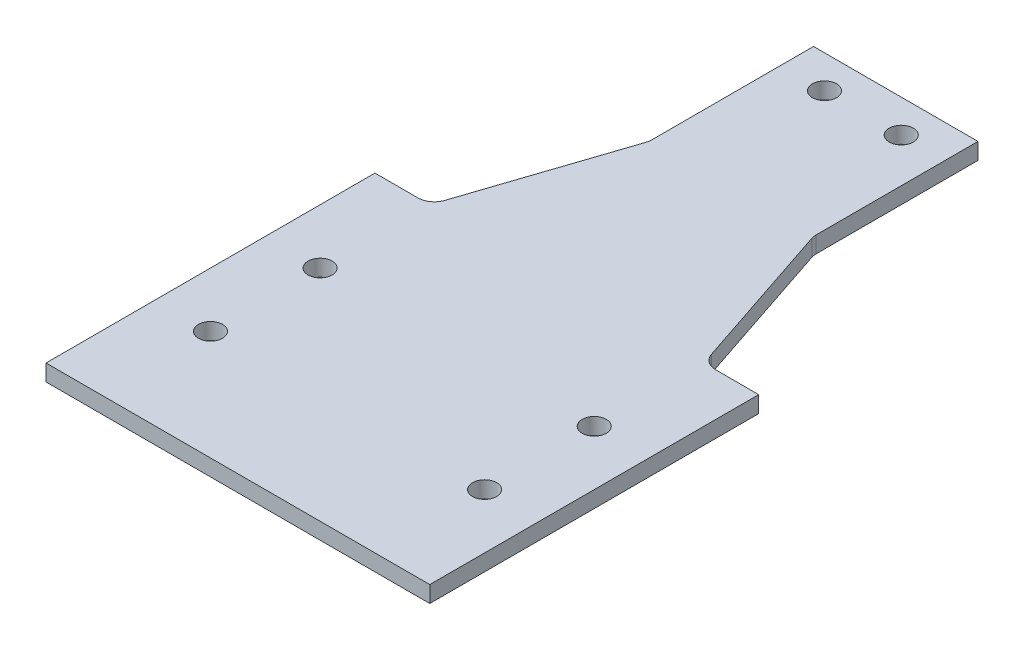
ISO-10303-21;
HEADER;
FILE_DESCRIPTION(('STEP AP214'),'2;1');
FILE_NAME('part.step','',(''),(''),'','','');
FILE_SCHEMA(('AUTOMOTIVE_DESIGN { 1 0 10303 214 1 1 1 1 }'));
ENDSEC;
DATA;
#1=APPLICATION_CONTEXT('core data for automotive mechanical design processes');
#2=APPLICATION_PROTOCOL_DEFINITION('international standard','automotive_design',2000,#1);
#3=PRODUCT_CONTEXT('',#1,'mechanical');
#4=PRODUCT('Part','Part','',(#3));
#5=PRODUCT_RELATED_PRODUCT_CATEGORY('part','',(#4));
#6=PRODUCT_DEFINITION_FORMATION('','',#4);
#7=PRODUCT_DEFINITION_CONTEXT('part definition',#1,'design');
#8=PRODUCT_DEFINITION('design','',#6,#7);
#9=PRODUCT_DEFINITION_SHAPE('','',#8);
#10=(LENGTH_UNIT() NAMED_UNIT(*) SI_UNIT(.MILLI.,.METRE.));
#11=(NAMED_UNIT(*) PLANE_ANGLE_UNIT() SI_UNIT($,.RADIAN.));
#12=(NAMED_UNIT(*) SI_UNIT($,.STERADIAN.) SOLID_ANGLE_UNIT());
#13=UNCERTAINTY_MEASURE_WITH_UNIT(LENGTH_MEASURE(1.E-05),#10,'distance_accuracy_value','');
#14=(GEOMETRIC_REPRESENTATION_CONTEXT(3) GLOBAL_UNCERTAINTY_ASSIGNED_CONTEXT((#13)) GLOBAL_UNIT_ASSIGNED_CONTEXT((#10,
#11,#12)) REPRESENTATION_CONTEXT('',''));
#15=CARTESIAN_POINT('',(0.,0.,0.));
#16=DIRECTION('',(0.,0.,1.));
#17=DIRECTION('',(1.,0.,0.));
#18=AXIS2_PLACEMENT_3D('',#15,#16,#17);
#19=CARTESIAN_POINT('',(-18.,3.,-0.486832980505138));
#20=DIRECTION('',(0.,-1.,0.));
#21=DIRECTION('',(0.,0.,-1.));
#22=AXIS2_PLACEMENT_3D('',#19,#20,#21);
#23=CYLINDRICAL_SURFACE('',#22,3.);
#24=CARTESIAN_POINT('',(-18.,0.,-0.486832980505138));
#25=DIRECTION('',(0.,1.,0.));
#26=DIRECTION('',(0.,0.,1.));
#27=AXIS2_PLACEMENT_3D('',#24,#25,#26);
#28=CIRCLE('',#27,3.);
#29=CARTESIAN_POINT('',(-15.1539501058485,0.,0.461850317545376));
#30=VERTEX_POINT('',#29);
#31=CARTESIAN_POINT('',(-15.,0.,-0.486832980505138));
#32=VERTEX_POINT('',#31);
#33=EDGE_CURVE('E267',#30,#32,#28,.T.);
#34=ORIENTED_EDGE('',*,*,#33,.F.);
#35=DIRECTION('',(0.,-1.,0.));
#36=VECTOR('',#35,1.);
#37=CARTESIAN_POINT('',(-15.1539501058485,0.,0.461850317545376));
#38=LINE('',#37,#36);
#39=CARTESIAN_POINT('',(-15.1539501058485,3.,0.461850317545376));
#40=VERTEX_POINT('',#39);
#41=EDGE_CURVE('E11',#40,#30,#38,.T.);
#42=ORIENTED_EDGE('',*,*,#41,.F.);
#43=CARTESIAN_POINT('',(-18.,3.,-0.486832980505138));
#44=DIRECTION('',(0.,-1.,0.));
#45=DIRECTION('',(0.,0.,1.));
#46=AXIS2_PLACEMENT_3D('',#43,#44,#45);
#47=CIRCLE('',#46,3.);
#48=CARTESIAN_POINT('',(-15.,3.,-0.486832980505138));
#49=VERTEX_POINT('',#48);
#50=EDGE_CURVE('E345',#49,#40,#47,.T.);
#51=ORIENTED_EDGE('',*,*,#50,.F.);
#52=DIRECTION('',(0.,1.,0.));
#53=VECTOR('',#52,1.);
#54=CARTESIAN_POINT('',(-15.,3.,-0.486832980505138));
#55=LINE('',#54,#53);
#56=EDGE_CURVE('E328',#32,#49,#55,.T.);
#57=ORIENTED_EDGE('',*,*,#56,.F.);
#58=EDGE_LOOP('',(#34,#42,#51,#57));
#59=FACE_BOUND('',#58,.T.);
#60=ADVANCED_FACE('F17',(#59),#23,.F.);
#61=CARTESIAN_POINT('',(-27.1622776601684,0.,27.));
#62=DIRECTION('',(0.,-1.,0.));
#63=DIRECTION('',(0.,0.,-1.));
#64=AXIS2_PLACEMENT_3D('',#61,#62,#63);
#65=CYLINDRICAL_SURFACE('',#64,3.);
#66=CARTESIAN_POINT('',(-27.1622776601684,0.,27.));
#67=DIRECTION('',(0.,1.,0.));
#68=DIRECTION('',(0.,0.,1.));
#69=AXIS2_PLACEMENT_3D('',#66,#67,#68);
#70=CIRCLE('',#69,3.);
#71=CARTESIAN_POINT('',(-27.1622776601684,0.,30.));
#72=VERTEX_POINT('',#71);
#73=CARTESIAN_POINT('',(-24.3162277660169,0.,27.9486832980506));
#74=VERTEX_POINT('',#73);
#75=EDGE_CURVE('E173',#72,#74,#70,.T.);
#76=ORIENTED_EDGE('',*,*,#75,.F.);
#77=DIRECTION('',(0.,-1.,0.));
#78=VECTOR('',#77,1.);
#79=CARTESIAN_POINT('',(-27.1622776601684,0.,30.));
#80=LINE('',#79,#78);
#81=CARTESIAN_POINT('',(-27.1622776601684,3.,30.));
#82=VERTEX_POINT('',#81);
#83=EDGE_CURVE('E170',#82,#72,#80,.T.);
#84=ORIENTED_EDGE('',*,*,#83,.F.);
#85=CARTESIAN_POINT('',(-27.1622776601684,3.,27.));
#86=DIRECTION('',(0.,-1.,0.));
#87=DIRECTION('',(0.,0.,1.));
#88=AXIS2_PLACEMENT_3D('',#85,#86,#87);
#89=CIRCLE('',#88,3.);
#90=CARTESIAN_POINT('',(-24.3162277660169,3.,27.9486832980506));
#91=VERTEX_POINT('',#90);
#92=EDGE_CURVE('E155',#91,#82,#89,.T.);
#93=ORIENTED_EDGE('',*,*,#92,.F.);
#94=DIRECTION('',(0.,1.,0.));
#95=VECTOR('',#94,1.);
#96=CARTESIAN_POINT('',(-24.3162277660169,3.,27.9486832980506));
#97=LINE('',#96,#95);
#98=EDGE_CURVE('E25',#74,#91,#97,.T.);
#99=ORIENTED_EDGE('',*,*,#98,.F.);
#100=EDGE_LOOP('',(#76,#84,#93,#99));
#101=FACE_BOUND('',#100,.T.);
#102=ADVANCED_FACE('F171',(#101),#65,.F.);
#103=CARTESIAN_POINT('',(18.,0.,-0.486832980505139));
#104=DIRECTION('',(0.,1.,0.));
#105=DIRECTION('',(0.,0.,1.));
#106=AXIS2_PLACEMENT_3D('',#103,#104,#105);
#107=CYLINDRICAL_SURFACE('',#106,3.);
#108=CARTESIAN_POINT('',(18.,0.,-0.486832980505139));
#109=DIRECTION('',(0.,1.,0.));
#110=DIRECTION('',(0.,0.,1.));
#111=AXIS2_PLACEMENT_3D('',#108,#109,#110);
#112=CIRCLE('',#111,3.);
#113=CARTESIAN_POINT('',(15.,0.,-0.486832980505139));
#114=VERTEX_POINT('',#113);
#115=CARTESIAN_POINT('',(15.1539501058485,0.,0.461850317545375));
#116=VERTEX_POINT('',#115);
#117=EDGE_CURVE('E270',#114,#116,#112,.T.);
#118=ORIENTED_EDGE('',*,*,#117,.F.);
#119=DIRECTION('',(0.,-1.,0.));
#120=VECTOR('',#119,1.);
#121=CARTESIAN_POINT('',(15.,3.,-0.486832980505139));
#122=LINE('',#121,#120);
#123=CARTESIAN_POINT('',(15.,3.,-0.486832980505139));
#124=VERTEX_POINT('',#123);
#125=EDGE_CURVE('E242',#124,#114,#122,.T.);
#126=ORIENTED_EDGE('',*,*,#125,.F.);
#127=CARTESIAN_POINT('',(18.,3.,-0.486832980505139));
#128=DIRECTION('',(0.,-1.,0.));
#129=DIRECTION('',(0.,0.,1.));
#130=AXIS2_PLACEMENT_3D('',#127,#128,#129);
#131=CIRCLE('',#130,3.);
#132=CARTESIAN_POINT('',(15.1539501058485,3.,0.461850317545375));
#133=VERTEX_POINT('',#132);
#134=EDGE_CURVE('E260',#133,#124,#131,.T.);
#135=ORIENTED_EDGE('',*,*,#134,.F.);
#136=DIRECTION('',(0.,1.,0.));
#137=VECTOR('',#136,1.);
#138=CARTESIAN_POINT('',(15.1539501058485,0.,0.461850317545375));
#139=LINE('',#138,#137);
#140=EDGE_CURVE('E49',#116,#133,#139,.T.);
#141=ORIENTED_EDGE('',*,*,#140,.F.);
#142=EDGE_LOOP('',(#118,#126,#135,#141));
#143=FACE_BOUND('',#142,.T.);
#144=ADVANCED_FACE('F836',(#143),#107,.F.);
#145=CARTESIAN_POINT('',(27.1622776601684,3.,27.));
#146=DIRECTION('',(0.,-1.,0.));
#147=DIRECTION('',(0.,0.,-1.));
#148=AXIS2_PLACEMENT_3D('',#145,#146,#147);
#149=CYLINDRICAL_SURFACE('',#148,3.);
#150=CARTESIAN_POINT('',(27.1622776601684,0.,27.));
#151=DIRECTION('',(0.,1.,0.));
#152=DIRECTION('',(0.,0.,1.));
#153=AXIS2_PLACEMENT_3D('',#150,#151,#152);
#154=CIRCLE('',#153,3.);
#155=CARTESIAN_POINT('',(24.3162277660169,0.,27.9486832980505));
#156=VERTEX_POINT('',#155);
#157=CARTESIAN_POINT('',(27.1622776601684,0.,30.));
#158=VERTEX_POINT('',#157);
#159=EDGE_CURVE('E255',#156,#158,#154,.T.);
#160=ORIENTED_EDGE('',*,*,#159,.F.);
#161=DIRECTION('',(0.,-1.,0.));
#162=VECTOR('',#161,1.);
#163=CARTESIAN_POINT('',(24.3162277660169,0.,27.9486832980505));
#164=LINE('',#163,#162);
#165=CARTESIAN_POINT('',(24.3162277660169,3.,27.9486832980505));
#166=VERTEX_POINT('',#165);
#167=EDGE_CURVE('E38',#166,#156,#164,.T.);
#168=ORIENTED_EDGE('',*,*,#167,.F.);
#169=CARTESIAN_POINT('',(27.1622776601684,3.,27.));
#170=DIRECTION('',(0.,-1.,0.));
#171=DIRECTION('',(0.,0.,1.));
#172=AXIS2_PLACEMENT_3D('',#169,#170,#171);
#173=CIRCLE('',#172,3.);
#174=CARTESIAN_POINT('',(27.1622776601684,3.,30.));
#175=VERTEX_POINT('',#174);
#176=EDGE_CURVE('E167',#175,#166,#173,.T.);
#177=ORIENTED_EDGE('',*,*,#176,.F.);
#178=DIRECTION('',(0.,1.,0.));
#179=VECTOR('',#178,1.);
#180=CARTESIAN_POINT('',(27.1622776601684,3.,30.));
#181=LINE('',#180,#179);
#182=EDGE_CURVE('E223',#158,#175,#181,.T.);
#183=ORIENTED_EDGE('',*,*,#182,.F.);
#184=EDGE_LOOP('',(#160,#168,#177,#183));
#185=FACE_BOUND('',#184,.T.);
#186=ADVANCED_FACE('F843',(#185),#149,.F.);
#187=CARTESIAN_POINT('',(-15.,0.,0.));
#188=DIRECTION('',(-0.948683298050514,0.,-0.316227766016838));
#189=DIRECTION('',(-0.316227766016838,0.,0.948683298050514));
#190=AXIS2_PLACEMENT_3D('',#187,#188,#189);
#191=PLANE('',#190);
#192=DIRECTION('',(-0.316227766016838,0.,0.948683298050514));
#193=VECTOR('',#192,1.);
#194=CARTESIAN_POINT('',(-15.,0.,0.));
#195=LINE('',#194,#193);
#196=EDGE_CURVE('E263',#30,#74,#195,.T.);
#197=ORIENTED_EDGE('',*,*,#196,.T.);
#198=ORIENTED_EDGE('',*,*,#98,.T.);
#199=DIRECTION('',(-0.316227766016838,0.,0.948683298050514));
#200=VECTOR('',#199,1.);
#201=CARTESIAN_POINT('',(-15.,3.,0.));
#202=LINE('',#201,#200);
#203=EDGE_CURVE('E164',#40,#91,#202,.T.);
#204=ORIENTED_EDGE('',*,*,#203,.F.);
#205=ORIENTED_EDGE('',*,*,#41,.T.);
#206=EDGE_LOOP('',(#197,#198,#204,#205));
#207=FACE_BOUND('',#206,.T.);
#208=ADVANCED_FACE('F370',(#207),#191,.T.);
#209=CARTESIAN_POINT('',(15.,0.,0.));
#210=DIRECTION('',(0.948683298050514,0.,-0.316227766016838));
#211=DIRECTION('',(0.,-1.,0.));
#212=AXIS2_PLACEMENT_3D('',#209,#210,#211);
#213=PLANE('',#212);
#214=DIRECTION('',(-0.316227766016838,0.,-0.948683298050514));
#215=VECTOR('',#214,1.);
#216=CARTESIAN_POINT('',(15.,3.,0.));
#217=LINE('',#216,#215);
#218=EDGE_CURVE('E256',#166,#133,#217,.T.);
#219=ORIENTED_EDGE('',*,*,#218,.F.);
#220=ORIENTED_EDGE('',*,*,#167,.T.);
#221=DIRECTION('',(-0.316227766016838,0.,-0.948683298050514));
#222=VECTOR('',#221,1.);
#223=CARTESIAN_POINT('',(15.,0.,0.));
#224=LINE('',#223,#222);
#225=EDGE_CURVE('E274',#156,#116,#224,.T.);
#226=ORIENTED_EDGE('',*,*,#225,.T.);
#227=ORIENTED_EDGE('',*,*,#140,.T.);
#228=EDGE_LOOP('',(#219,#220,#226,#227));
#229=FACE_BOUND('',#228,.T.);
#230=ADVANCED_FACE('F859',(#229),#213,.T.);
#231=CARTESIAN_POINT('',(0.,0.,0.));
#232=DIRECTION('',(0.,1.,0.));
#233=DIRECTION('',(1.,0.,0.));
#234=AXIS2_PLACEMENT_3D('',#231,#232,#233);
#235=PLANE('',#234);
#236=CARTESIAN_POINT('',(-25.,0.,70.));
#237=DIRECTION('',(0.,1.,0.));
#238=DIRECTION('',(0.,0.,1.));
#239=AXIS2_PLACEMENT_3D('',#236,#237,#238);
#240=CIRCLE('',#239,2.2);
#241=CARTESIAN_POINT('',(-25.,0.,72.2));
#242=VERTEX_POINT('',#241);
#243=EDGE_CURVE('E292',#242,#242,#240,.T.);
#244=ORIENTED_EDGE('',*,*,#243,.T.);
#245=EDGE_LOOP('',(#244));
#246=FACE_BOUND('',#245,.T.);
#247=CARTESIAN_POINT('',(25.,0.,70.));
#248=DIRECTION('',(0.,1.,0.));
#249=DIRECTION('',(0.,0.,1.));
#250=AXIS2_PLACEMENT_3D('',#247,#248,#249);
#251=CIRCLE('',#250,2.2);
#252=CARTESIAN_POINT('',(25.,0.,72.2));
#253=VERTEX_POINT('',#252);
#254=EDGE_CURVE('E329',#253,#253,#251,.T.);
#255=ORIENTED_EDGE('',*,*,#254,.T.);
#256=EDGE_LOOP('',(#255));
#257=FACE_BOUND('',#256,.T.);
#258=CARTESIAN_POINT('',(-25.,0.,50.));
#259=DIRECTION('',(0.,1.,0.));
#260=DIRECTION('',(0.,0.,1.));
#261=AXIS2_PLACEMENT_3D('',#258,#259,#260);
#262=CIRCLE('',#261,2.2);
#263=CARTESIAN_POINT('',(-25.,0.,52.2));
#264=VERTEX_POINT('',#263);
#265=EDGE_CURVE('E317',#264,#264,#262,.T.);
#266=ORIENTED_EDGE('',*,*,#265,.T.);
#267=EDGE_LOOP('',(#266));
#268=FACE_BOUND('',#267,.T.);
#269=CARTESIAN_POINT('',(25.,0.,50.));
#270=DIRECTION('',(0.,1.,0.));
#271=DIRECTION('',(0.,0.,1.));
#272=AXIS2_PLACEMENT_3D('',#269,#270,#271);
#273=CIRCLE('',#272,2.2);
#274=CARTESIAN_POINT('',(25.,0.,52.2));
#275=VERTEX_POINT('',#274);
#276=EDGE_CURVE('E309',#275,#275,#273,.T.);
#277=ORIENTED_EDGE('',*,*,#276,.T.);
#278=EDGE_LOOP('',(#277));
#279=FACE_BOUND('',#278,.T.);
#280=CARTESIAN_POINT('',(-7.,0.,-24.));
#281=DIRECTION('',(0.,1.,0.));
#282=DIRECTION('',(0.,0.,1.));
#283=AXIS2_PLACEMENT_3D('',#280,#281,#282);
#284=CIRCLE('',#283,2.2);
#285=CARTESIAN_POINT('',(-7.,0.,-21.8));
#286=VERTEX_POINT('',#285);
#287=EDGE_CURVE('E301',#286,#286,#284,.T.);
#288=ORIENTED_EDGE('',*,*,#287,.T.);
#289=EDGE_LOOP('',(#288));
#290=FACE_BOUND('',#289,.T.);
#291=CARTESIAN_POINT('',(7.,0.,-24.));
#292=DIRECTION('',(0.,1.,0.));
#293=DIRECTION('',(0.,0.,1.));
#294=AXIS2_PLACEMENT_3D('',#291,#292,#293);
#295=CIRCLE('',#294,2.2);
#296=CARTESIAN_POINT('',(7.,0.,-21.8));
#297=VERTEX_POINT('',#296);
#298=EDGE_CURVE('E291',#297,#297,#295,.T.);
#299=ORIENTED_EDGE('',*,*,#298,.T.);
#300=EDGE_LOOP('',(#299));
#301=FACE_BOUND('',#300,.T.);
#302=ORIENTED_EDGE('',*,*,#196,.F.);
#303=ORIENTED_EDGE('',*,*,#33,.T.);
#304=DIRECTION('',(0.,0.,-1.));
#305=VECTOR('',#304,1.);
#306=CARTESIAN_POINT('',(-15.,0.,0.));
#307=LINE('',#306,#305);
#308=CARTESIAN_POINT('',(-15.,0.,-30.));
#309=VERTEX_POINT('',#308);
#310=EDGE_CURVE('E324',#32,#309,#307,.T.);
#311=ORIENTED_EDGE('',*,*,#310,.T.);
#312=DIRECTION('',(1.,0.,0.));
#313=VECTOR('',#312,1.);
#314=CARTESIAN_POINT('',(0.,0.,-30.));
#315=LINE('',#314,#313);
#316=CARTESIAN_POINT('',(15.,0.,-30.));
#317=VERTEX_POINT('',#316);
#318=EDGE_CURVE('E198',#309,#317,#315,.T.);
#319=ORIENTED_EDGE('',*,*,#318,.T.);
#320=DIRECTION('',(0.,0.,-1.));
#321=VECTOR('',#320,1.);
#322=CARTESIAN_POINT('',(15.,0.,0.));
#323=LINE('',#322,#321);
#324=EDGE_CURVE('E246',#114,#317,#323,.T.);
#325=ORIENTED_EDGE('',*,*,#324,.F.);
#326=ORIENTED_EDGE('',*,*,#117,.T.);
#327=ORIENTED_EDGE('',*,*,#225,.F.);
#328=ORIENTED_EDGE('',*,*,#159,.T.);
#329=DIRECTION('',(1.,0.,0.));
#330=VECTOR('',#329,1.);
#331=CARTESIAN_POINT('',(0.,0.,30.));
#332=LINE('',#331,#330);
#333=CARTESIAN_POINT('',(35.,0.,30.));
#334=VERTEX_POINT('',#333);
#335=EDGE_CURVE('E233',#158,#334,#332,.T.);
#336=ORIENTED_EDGE('',*,*,#335,.T.);
#337=DIRECTION('',(0.,0.,1.));
#338=VECTOR('',#337,1.);
#339=CARTESIAN_POINT('',(35.,0.,0.));
#340=LINE('',#339,#338);
#341=CARTESIAN_POINT('',(35.,0.,90.));
#342=VERTEX_POINT('',#341);
#343=EDGE_CURVE('E218',#334,#342,#340,.T.);
#344=ORIENTED_EDGE('',*,*,#343,.T.);
#345=DIRECTION('',(1.,0.,0.));
#346=VECTOR('',#345,1.);
#347=CARTESIAN_POINT('',(0.,0.,90.));
#348=LINE('',#347,#346);
#349=CARTESIAN_POINT('',(-35.,0.,90.));
#350=VERTEX_POINT('',#349);
#351=EDGE_CURVE('E209',#350,#342,#348,.T.);
#352=ORIENTED_EDGE('',*,*,#351,.F.);
#353=DIRECTION('',(0.,0.,1.));
#354=VECTOR('',#353,1.);
#355=CARTESIAN_POINT('',(-35.,0.,0.));
#356=LINE('',#355,#354);
#357=CARTESIAN_POINT('',(-35.,0.,30.));
#358=VERTEX_POINT('',#357);
#359=EDGE_CURVE('E208',#358,#350,#356,.T.);
#360=ORIENTED_EDGE('',*,*,#359,.F.);
#361=DIRECTION('',(1.,0.,0.));
#362=VECTOR('',#361,1.);
#363=CARTESIAN_POINT('',(0.,0.,30.));
#364=LINE('',#363,#362);
#365=EDGE_CURVE('E178',#358,#72,#364,.T.);
#366=ORIENTED_EDGE('',*,*,#365,.T.);
#367=ORIENTED_EDGE('',*,*,#75,.T.);
#368=EDGE_LOOP('',(#302,#303,#311,#319,#325,#326,#327,#328,#336,#344,#352,#360,#366,#367));
#369=FACE_BOUND('',#368,.T.);
#370=ADVANCED_FACE('F366',(#246,#257,#268,#279,#290,#301,#369),#235,.F.);
#371=CARTESIAN_POINT('',(0.,3.,0.));
#372=DIRECTION('',(0.,1.,0.));
#373=DIRECTION('',(1.,0.,0.));
#374=AXIS2_PLACEMENT_3D('',#371,#372,#373);
#375=PLANE('',#374);
#376=CARTESIAN_POINT('',(-25.,3.,70.));
#377=DIRECTION('',(0.,1.,0.));
#378=DIRECTION('',(0.,0.,1.));
#379=AXIS2_PLACEMENT_3D('',#376,#377,#378);
#380=CIRCLE('',#379,2.2);
#381=CARTESIAN_POINT('',(-25.,3.,72.2));
#382=VERTEX_POINT('',#381);
#383=EDGE_CURVE('E565',#382,#382,#380,.T.);
#384=ORIENTED_EDGE('',*,*,#383,.F.);
#385=EDGE_LOOP('',(#384));
#386=FACE_BOUND('',#385,.T.);
#387=CARTESIAN_POINT('',(25.,3.,70.));
#388=DIRECTION('',(0.,1.,0.));
#389=DIRECTION('',(0.,0.,1.));
#390=AXIS2_PLACEMENT_3D('',#387,#388,#389);
#391=CIRCLE('',#390,2.2);
#392=CARTESIAN_POINT('',(25.,3.,72.2));
#393=VERTEX_POINT('',#392);
#394=EDGE_CURVE('E321',#393,#393,#391,.T.);
#395=ORIENTED_EDGE('',*,*,#394,.F.);
#396=EDGE_LOOP('',(#395));
#397=FACE_BOUND('',#396,.T.);
#398=CARTESIAN_POINT('',(-25.,3.,50.));
#399=DIRECTION('',(0.,1.,0.));
#400=DIRECTION('',(0.,0.,1.));
#401=AXIS2_PLACEMENT_3D('',#398,#399,#400);
#402=CIRCLE('',#401,2.2);
#403=CARTESIAN_POINT('',(-25.,3.,52.2));
#404=VERTEX_POINT('',#403);
#405=EDGE_CURVE('E313',#404,#404,#402,.T.);
#406=ORIENTED_EDGE('',*,*,#405,.F.);
#407=EDGE_LOOP('',(#406));
#408=FACE_BOUND('',#407,.T.);
#409=CARTESIAN_POINT('',(25.,3.,50.));
#410=DIRECTION('',(0.,1.,0.));
#411=DIRECTION('',(0.,0.,1.));
#412=AXIS2_PLACEMENT_3D('',#409,#410,#411);
#413=CIRCLE('',#412,2.2);
#414=CARTESIAN_POINT('',(25.,3.,52.2));
#415=VERTEX_POINT('',#414);
#416=EDGE_CURVE('E304',#415,#415,#413,.T.);
#417=ORIENTED_EDGE('',*,*,#416,.F.);
#418=EDGE_LOOP('',(#417));
#419=FACE_BOUND('',#418,.T.);
#420=CARTESIAN_POINT('',(-7.,3.,-24.));
#421=DIRECTION('',(0.,1.,0.));
#422=DIRECTION('',(0.,0.,1.));
#423=AXIS2_PLACEMENT_3D('',#420,#421,#422);
#424=CIRCLE('',#423,2.2);
#425=CARTESIAN_POINT('',(-7.,3.,-21.8));
#426=VERTEX_POINT('',#425);
#427=EDGE_CURVE('E298',#426,#426,#424,.T.);
#428=ORIENTED_EDGE('',*,*,#427,.F.);
#429=EDGE_LOOP('',(#428));
#430=FACE_BOUND('',#429,.T.);
#431=CARTESIAN_POINT('',(7.,3.,-24.));
#432=DIRECTION('',(0.,1.,0.));
#433=DIRECTION('',(0.,0.,1.));
#434=AXIS2_PLACEMENT_3D('',#431,#432,#433);
#435=CIRCLE('',#434,2.2);
#436=CARTESIAN_POINT('',(7.,3.,-21.8));
#437=VERTEX_POINT('',#436);
#438=EDGE_CURVE('E287',#437,#437,#435,.T.);
#439=ORIENTED_EDGE('',*,*,#438,.F.);
#440=EDGE_LOOP('',(#439));
#441=FACE_BOUND('',#440,.T.);
#442=DIRECTION('',(0.,0.,-1.));
#443=VECTOR('',#442,1.);
#444=CARTESIAN_POINT('',(-15.,3.,0.));
#445=LINE('',#444,#443);
#446=CARTESIAN_POINT('',(-15.,3.,-30.));
#447=VERTEX_POINT('',#446);
#448=EDGE_CURVE('E192',#49,#447,#445,.T.);
#449=ORIENTED_EDGE('',*,*,#448,.F.);
#450=ORIENTED_EDGE('',*,*,#50,.T.);
#451=ORIENTED_EDGE('',*,*,#203,.T.);
#452=ORIENTED_EDGE('',*,*,#92,.T.);
#453=DIRECTION('',(1.,0.,0.));
#454=VECTOR('',#453,1.);
#455=CARTESIAN_POINT('',(0.,3.,30.));
#456=LINE('',#455,#454);
#457=CARTESIAN_POINT('',(-35.,3.,30.));
#458=VERTEX_POINT('',#457);
#459=EDGE_CURVE('E161',#458,#82,#456,.T.);
#460=ORIENTED_EDGE('',*,*,#459,.F.);
#461=DIRECTION('',(0.,0.,1.));
#462=VECTOR('',#461,1.);
#463=CARTESIAN_POINT('',(-35.,3.,0.));
#464=LINE('',#463,#462);
#465=CARTESIAN_POINT('',(-35.,3.,90.));
#466=VERTEX_POINT('',#465);
#467=EDGE_CURVE('E207',#458,#466,#464,.T.);
#468=ORIENTED_EDGE('',*,*,#467,.T.);
#469=DIRECTION('',(1.,0.,0.));
#470=VECTOR('',#469,1.);
#471=CARTESIAN_POINT('',(0.,3.,90.));
#472=LINE('',#471,#470);
#473=CARTESIAN_POINT('',(35.,3.,90.));
#474=VERTEX_POINT('',#473);
#475=EDGE_CURVE('E214',#466,#474,#472,.T.);
#476=ORIENTED_EDGE('',*,*,#475,.T.);
#477=DIRECTION('',(0.,0.,1.));
#478=VECTOR('',#477,1.);
#479=CARTESIAN_POINT('',(35.,3.,0.));
#480=LINE('',#479,#478);
#481=CARTESIAN_POINT('',(35.,3.,30.));
#482=VERTEX_POINT('',#481);
#483=EDGE_CURVE('E230',#482,#474,#480,.T.);
#484=ORIENTED_EDGE('',*,*,#483,.F.);
#485=DIRECTION('',(1.,0.,0.));
#486=VECTOR('',#485,1.);
#487=CARTESIAN_POINT('',(0.,3.,30.));
#488=LINE('',#487,#486);
#489=EDGE_CURVE('E219',#175,#482,#488,.T.);
#490=ORIENTED_EDGE('',*,*,#489,.F.);
#491=ORIENTED_EDGE('',*,*,#176,.T.);
#492=ORIENTED_EDGE('',*,*,#218,.T.);
#493=ORIENTED_EDGE('',*,*,#134,.T.);
#494=DIRECTION('',(0.,0.,-1.));
#495=VECTOR('',#494,1.);
#496=CARTESIAN_POINT('',(15.,3.,0.));
#497=LINE('',#496,#495);
#498=CARTESIAN_POINT('',(15.,3.,-30.));
#499=VERTEX_POINT('',#498);
#500=EDGE_CURVE('E222',#124,#499,#497,.T.);
#501=ORIENTED_EDGE('',*,*,#500,.T.);
#502=DIRECTION('',(1.,0.,0.));
#503=VECTOR('',#502,1.);
#504=CARTESIAN_POINT('',(0.,3.,-30.));
#505=LINE('',#504,#503);
#506=EDGE_CURVE('E201',#447,#499,#505,.T.);
#507=ORIENTED_EDGE('',*,*,#506,.F.);
#508=EDGE_LOOP('',(#449,#450,#451,#452,#460,#468,#476,#484,#490,#491,#492,#493,#501,#507));
#509=FACE_BOUND('',#508,.T.);
#510=ADVANCED_FACE('F158',(#386,#397,#408,#419,#430,#441,#509),#375,.T.);
#511=CARTESIAN_POINT('',(0.,3.,-30.));
#512=DIRECTION('',(0.,0.,-1.));
#513=DIRECTION('',(0.,-1.,0.));
#514=AXIS2_PLACEMENT_3D('',#511,#512,#513);
#515=PLANE('',#514);
#516=ORIENTED_EDGE('',*,*,#318,.F.);
#517=DIRECTION('',(0.,-1.,0.));
#518=VECTOR('',#517,1.);
#519=CARTESIAN_POINT('',(-15.,3.,-30.));
#520=LINE('',#519,#518);
#521=EDGE_CURVE('E185',#447,#309,#520,.T.);
#522=ORIENTED_EDGE('',*,*,#521,.F.);
#523=ORIENTED_EDGE('',*,*,#506,.T.);
#524=DIRECTION('',(0.,-1.,0.));
#525=VECTOR('',#524,1.);
#526=CARTESIAN_POINT('',(15.,3.,-30.));
#527=LINE('',#526,#525);
#528=EDGE_CURVE('E202',#499,#317,#527,.T.);
#529=ORIENTED_EDGE('',*,*,#528,.T.);
#530=EDGE_LOOP('',(#516,#522,#523,#529));
#531=FACE_BOUND('',#530,.T.);
#532=ADVANCED_FACE('F362',(#531),#515,.T.);
#533=CARTESIAN_POINT('',(15.,3.,0.));
#534=DIRECTION('',(-1.,0.,0.));
#535=DIRECTION('',(0.,0.,1.));
#536=AXIS2_PLACEMENT_3D('',#533,#534,#535);
#537=PLANE('',#536);
#538=ORIENTED_EDGE('',*,*,#500,.F.);
#539=ORIENTED_EDGE('',*,*,#125,.T.);
#540=ORIENTED_EDGE('',*,*,#324,.T.);
#541=ORIENTED_EDGE('',*,*,#528,.F.);
#542=EDGE_LOOP('',(#538,#539,#540,#541));
#543=FACE_BOUND('',#542,.T.);
#544=ADVANCED_FACE('F890',(#543),#537,.F.);
#545=CARTESIAN_POINT('',(0.,3.,30.));
#546=DIRECTION('',(0.,0.,-1.));
#547=DIRECTION('',(-1.,0.,0.));
#548=AXIS2_PLACEMENT_3D('',#545,#546,#547);
#549=PLANE('',#548);
#550=ORIENTED_EDGE('',*,*,#335,.F.);
#551=ORIENTED_EDGE('',*,*,#182,.T.);
#552=ORIENTED_EDGE('',*,*,#489,.T.);
#553=DIRECTION('',(0.,-1.,0.));
#554=VECTOR('',#553,1.);
#555=CARTESIAN_POINT('',(35.,3.,30.));
#556=LINE('',#555,#554);
#557=EDGE_CURVE('E226',#482,#334,#556,.T.);
#558=ORIENTED_EDGE('',*,*,#557,.T.);
#559=EDGE_LOOP('',(#550,#551,#552,#558));
#560=FACE_BOUND('',#559,.T.);
#561=ADVANCED_FACE('F898',(#560),#549,.T.);
#562=CARTESIAN_POINT('',(35.,3.,0.));
#563=DIRECTION('',(1.,0.,0.));
#564=DIRECTION('',(0.,0.,-1.));
#565=AXIS2_PLACEMENT_3D('',#562,#563,#564);
#566=PLANE('',#565);
#567=ORIENTED_EDGE('',*,*,#343,.F.);
#568=ORIENTED_EDGE('',*,*,#557,.F.);
#569=ORIENTED_EDGE('',*,*,#483,.T.);
#570=DIRECTION('',(0.,-1.,0.));
#571=VECTOR('',#570,1.);
#572=CARTESIAN_POINT('',(35.,3.,90.));
#573=LINE('',#572,#571);
#574=EDGE_CURVE('E213',#474,#342,#573,.T.);
#575=ORIENTED_EDGE('',*,*,#574,.T.);
#576=EDGE_LOOP('',(#567,#568,#569,#575));
#577=FACE_BOUND('',#576,.T.);
#578=ADVANCED_FACE('F907',(#577),#566,.T.);
#579=CARTESIAN_POINT('',(0.,3.,90.));
#580=DIRECTION('',(0.,0.,-1.));
#581=DIRECTION('',(0.,-1.,0.));
#582=AXIS2_PLACEMENT_3D('',#579,#580,#581);
#583=PLANE('',#582);
#584=ORIENTED_EDGE('',*,*,#351,.T.);
#585=ORIENTED_EDGE('',*,*,#574,.F.);
#586=ORIENTED_EDGE('',*,*,#475,.F.);
#587=DIRECTION('',(0.,-1.,0.));
#588=VECTOR('',#587,1.);
#589=CARTESIAN_POINT('',(-35.,3.,90.));
#590=LINE('',#589,#588);
#591=EDGE_CURVE('E203',#466,#350,#590,.T.);
#592=ORIENTED_EDGE('',*,*,#591,.T.);
#593=EDGE_LOOP('',(#584,#585,#586,#592));
#594=FACE_BOUND('',#593,.T.);
#595=ADVANCED_FACE('F913',(#594),#583,.F.);
#596=CARTESIAN_POINT('',(-35.,3.,0.));
#597=DIRECTION('',(1.,0.,0.));
#598=DIRECTION('',(0.,0.,-1.));
#599=AXIS2_PLACEMENT_3D('',#596,#597,#598);
#600=PLANE('',#599);
#601=ORIENTED_EDGE('',*,*,#359,.T.);
#602=ORIENTED_EDGE('',*,*,#591,.F.);
#603=ORIENTED_EDGE('',*,*,#467,.F.);
#604=DIRECTION('',(0.,-1.,0.));
#605=VECTOR('',#604,1.);
#606=CARTESIAN_POINT('',(-35.,3.,30.));
#607=LINE('',#606,#605);
#608=EDGE_CURVE('E183',#458,#358,#607,.T.);
#609=ORIENTED_EDGE('',*,*,#608,.T.);
#610=EDGE_LOOP('',(#601,#602,#603,#609));
#611=FACE_BOUND('',#610,.T.);
#612=ADVANCED_FACE('F917',(#611),#600,.F.);
#613=CARTESIAN_POINT('',(0.,3.,30.));
#614=DIRECTION('',(0.,0.,-1.));
#615=DIRECTION('',(-1.,0.,0.));
#616=AXIS2_PLACEMENT_3D('',#613,#614,#615);
#617=PLANE('',#616);
#618=ORIENTED_EDGE('',*,*,#459,.T.);
#619=ORIENTED_EDGE('',*,*,#83,.T.);
#620=ORIENTED_EDGE('',*,*,#365,.F.);
#621=ORIENTED_EDGE('',*,*,#608,.F.);
#622=EDGE_LOOP('',(#618,#619,#620,#621));
#623=FACE_BOUND('',#622,.T.);
#624=ADVANCED_FACE('F181',(#623),#617,.T.);
#625=CARTESIAN_POINT('',(-15.,3.,0.));
#626=DIRECTION('',(-1.,0.,0.));
#627=DIRECTION('',(0.,0.,1.));
#628=AXIS2_PLACEMENT_3D('',#625,#626,#627);
#629=PLANE('',#628);
#630=ORIENTED_EDGE('',*,*,#310,.F.);
#631=ORIENTED_EDGE('',*,*,#56,.T.);
#632=ORIENTED_EDGE('',*,*,#448,.T.);
#633=ORIENTED_EDGE('',*,*,#521,.T.);
#634=EDGE_LOOP('',(#630,#631,#632,#633));
#635=FACE_BOUND('',#634,.T.);
#636=ADVANCED_FACE('F354',(#635),#629,.T.);
#637=CARTESIAN_POINT('',(25.,3.,70.));
#638=DIRECTION('',(0.,-1.,0.));
#639=DIRECTION('',(0.,0.,-1.));
#640=AXIS2_PLACEMENT_3D('',#637,#638,#639);
#641=CYLINDRICAL_SURFACE('',#640,2.2);
#642=ORIENTED_EDGE('',*,*,#254,.F.);
#643=EDGE_LOOP('',(#642));
#644=FACE_BOUND('',#643,.T.);
#645=ORIENTED_EDGE('',*,*,#394,.T.);
#646=EDGE_LOOP('',(#645));
#647=FACE_BOUND('',#646,.T.);
#648=ADVANCED_FACE('F671',(#644,#647),#641,.F.);
#649=CARTESIAN_POINT('',(-25.,3.,50.));
#650=DIRECTION('',(0.,-1.,0.));
#651=DIRECTION('',(0.,0.,-1.));
#652=AXIS2_PLACEMENT_3D('',#649,#650,#651);
#653=CYLINDRICAL_SURFACE('',#652,2.2);
#654=ORIENTED_EDGE('',*,*,#265,.F.);
#655=EDGE_LOOP('',(#654));
#656=FACE_BOUND('',#655,.T.);
#657=ORIENTED_EDGE('',*,*,#405,.T.);
#658=EDGE_LOOP('',(#657));
#659=FACE_BOUND('',#658,.T.);
#660=ADVANCED_FACE('F659',(#656,#659),#653,.F.);
#661=CARTESIAN_POINT('',(25.,3.,50.));
#662=DIRECTION('',(0.,-1.,0.));
#663=DIRECTION('',(0.,0.,-1.));
#664=AXIS2_PLACEMENT_3D('',#661,#662,#663);
#665=CYLINDRICAL_SURFACE('',#664,2.2);
#666=ORIENTED_EDGE('',*,*,#276,.F.);
#667=EDGE_LOOP('',(#666));
#668=FACE_BOUND('',#667,.T.);
#669=ORIENTED_EDGE('',*,*,#416,.T.);
#670=EDGE_LOOP('',(#669));
#671=FACE_BOUND('',#670,.T.);
#672=ADVANCED_FACE('F647',(#668,#671),#665,.F.);
#673=CARTESIAN_POINT('',(-7.,3.,-24.));
#674=DIRECTION('',(0.,-1.,0.));
#675=DIRECTION('',(0.,0.,-1.));
#676=AXIS2_PLACEMENT_3D('',#673,#674,#675);
#677=CYLINDRICAL_SURFACE('',#676,2.2);
#678=ORIENTED_EDGE('',*,*,#287,.F.);
#679=EDGE_LOOP('',(#678));
#680=FACE_BOUND('',#679,.T.);
#681=ORIENTED_EDGE('',*,*,#427,.T.);
#682=EDGE_LOOP('',(#681));
#683=FACE_BOUND('',#682,.T.);
#684=ADVANCED_FACE('F635',(#680,#683),#677,.F.);
#685=CARTESIAN_POINT('',(7.,3.,-24.));
#686=DIRECTION('',(0.,-1.,0.));
#687=DIRECTION('',(0.,0.,-1.));
#688=AXIS2_PLACEMENT_3D('',#685,#686,#687);
#689=CYLINDRICAL_SURFACE('',#688,2.2);
#690=ORIENTED_EDGE('',*,*,#298,.F.);
#691=EDGE_LOOP('',(#690));
#692=FACE_BOUND('',#691,.T.);
#693=ORIENTED_EDGE('',*,*,#438,.T.);
#694=EDGE_LOOP('',(#693));
#695=FACE_BOUND('',#694,.T.);
#696=ADVANCED_FACE('F622',(#692,#695),#689,.F.);
#697=CARTESIAN_POINT('',(-25.,3.,70.));
#698=DIRECTION('',(0.,-1.,0.));
#699=DIRECTION('',(0.,0.,-1.));
#700=AXIS2_PLACEMENT_3D('',#697,#698,#699);
#701=CYLINDRICAL_SURFACE('',#700,2.2);
#702=ORIENTED_EDGE('',*,*,#243,.F.);
#703=EDGE_LOOP('',(#702));
#704=FACE_BOUND('',#703,.T.);
#705=ORIENTED_EDGE('',*,*,#383,.T.);
#706=EDGE_LOOP('',(#705));
#707=FACE_BOUND('',#706,.T.);
#708=ADVANCED_FACE('F616',(#704,#707),#701,.F.);
#709=CLOSED_SHELL('',(#60,#102,#144,#186,#208,#230,#370,#510,#532,#544,#561,#578,#595,#612,#624,
#636,#648,#660,#672,#684,#696,#708));
#710=MANIFOLD_SOLID_BREP('B1',#709);
#711=ADVANCED_BREP_SHAPE_REPRESENTATION('',(#18,#710),#14);
#712=SHAPE_DEFINITION_REPRESENTATION(#9,#711);
ENDSEC;
END-ISO-10303-21;
